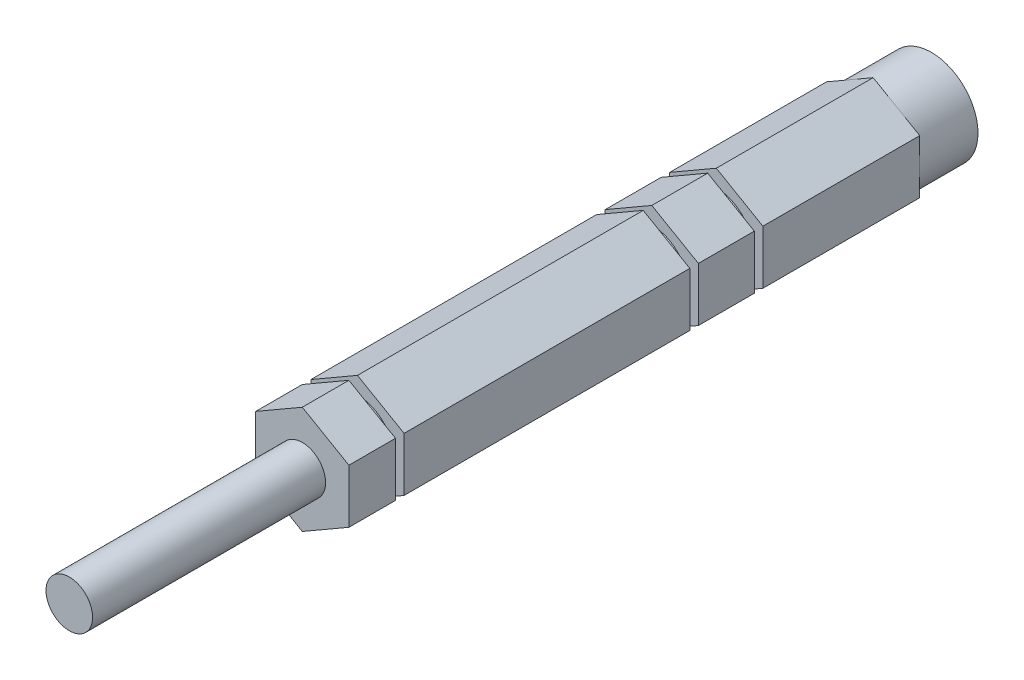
from build123d import *

# Parameters (mm, degrees)
BOSS_EXTRUDE1_DEPTH = 117.475
SKETCH8_W           = 10.718588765
SKETCH8_H           = 7.9375
SKETCH8_W_2         = 13.893588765
SKETCH8_H_2         = 31.75
SKETCH9_W           = 2.303148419
SKETCH9_H           = 1.1684


with BuildPart() as part:
    # Sketch1 → Boss-Extrude1 (new body)
    with BuildSketch(Plane.XY):
        Polygon((-6.35, 3.666174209), (-6.35, -3.666174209), (0, -7.332348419), (6.35, -3.666174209), (6.35, 3.666174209), (0, 7.332348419), align=None)
    extrude(amount=BOSS_EXTRUDE1_DEPTH)

    # Sketch8 → Cut-Revolve1 (revolve, cut)
    with BuildSketch(Plane(origin=(0, 0, 0), x_dir=(1, 0, 0), z_dir=(0, 1, 0))):
        with Locations((11.709294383, -3.96875)):
            Rectangle(SKETCH8_W, SKETCH8_H)
        with Locations((10.121794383, -101.6)):
            Rectangle(SKETCH8_W_2, SKETCH8_H_2)
    revolve(axis=Axis((0, 0, 0), (0, 0, 1)), mode=Mode.SUBTRACT)

    # Sketch9 → Cut-Revolve2 (revolve, cut)
    with BuildSketch(Plane(origin=(0, 0, 0), x_dir=(0.8660254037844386, -0.5000000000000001, 0), z_dir=(0.5000000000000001, 0.8660254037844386, 0)), mode=Mode.PRIVATE) as cut_revolve2_sk:
        with Locations((6.18077421, -29.8958)):
            Rectangle(SKETCH9_W, SKETCH9_H)
        with Locations((6.18077421, -38.6842)):
            Rectangle(SKETCH9_W, SKETCH9_H)
        with Locations((6.18077421, -78.7908)):
            Rectangle(SKETCH9_W, SKETCH9_H)
    revolve(cut_revolve2_sk.sketch.rotate(Axis((0, 0, 0), (0, 0, 1)), 210), axis=Axis((0, 0, 0), (0, 0, 1)), mode=Mode.SUBTRACT)


solid = part.part
